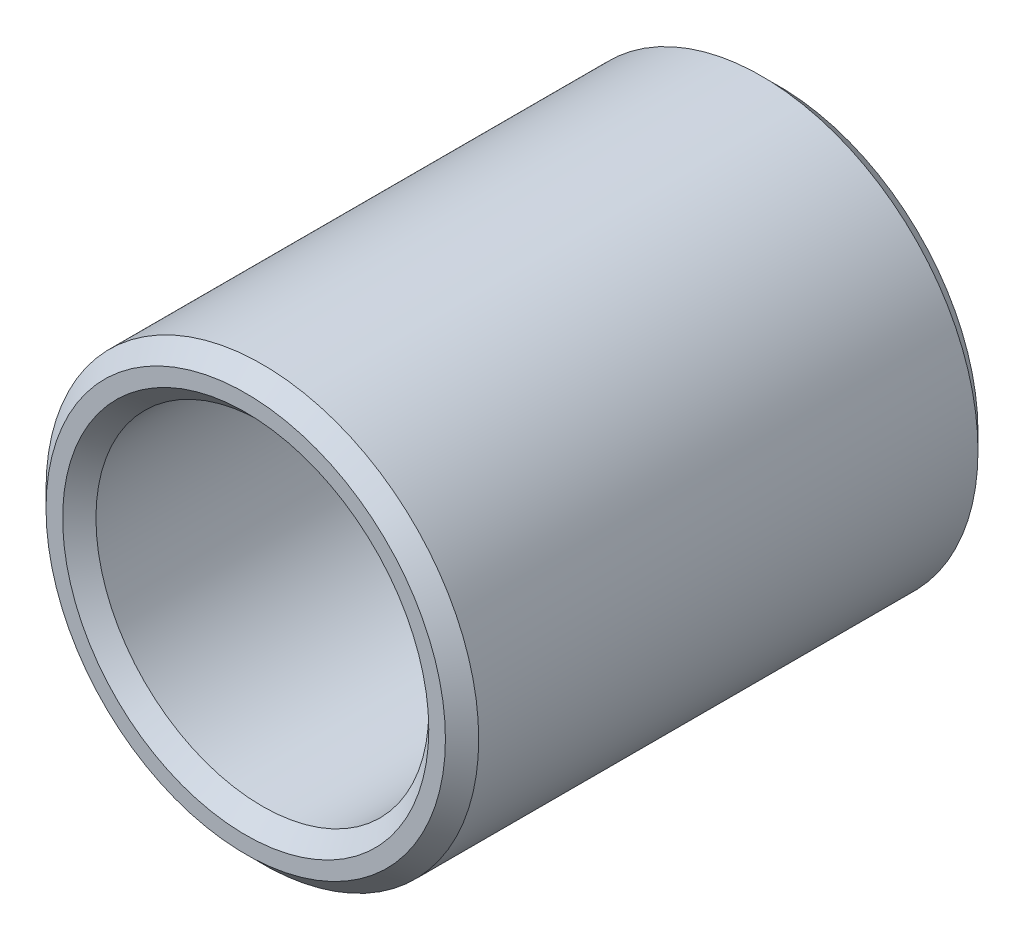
from build123d import *

# Parameters (mm, degrees)
ESQUISSE1_R      = 13
ESQUISSE1_R_2    = 10
EXTRUSION1_DEPTH = 32
CHANFREIN1_SIZE  = 1


with BuildPart() as part:
    # Esquisse1 → Extrusion1 (new body)
    with BuildSketch(Plane.XY):
        Circle(ESQUISSE1_R)
        Circle(ESQUISSE1_R_2, mode=Mode.SUBTRACT)
    extrude(amount=EXTRUSION1_DEPTH)

    # Chanfrein1
    chanfrein1_edges = [part.edges().sort_by_distance(p)[0] for p in [
        (-13, 0, 0),
        (-13, 0, 32),
        (-10, 0, 0),
        (-10, 0, 32),
    ]]
    chamfer(chanfrein1_edges, length=CHANFREIN1_SIZE)


solid = part.part
